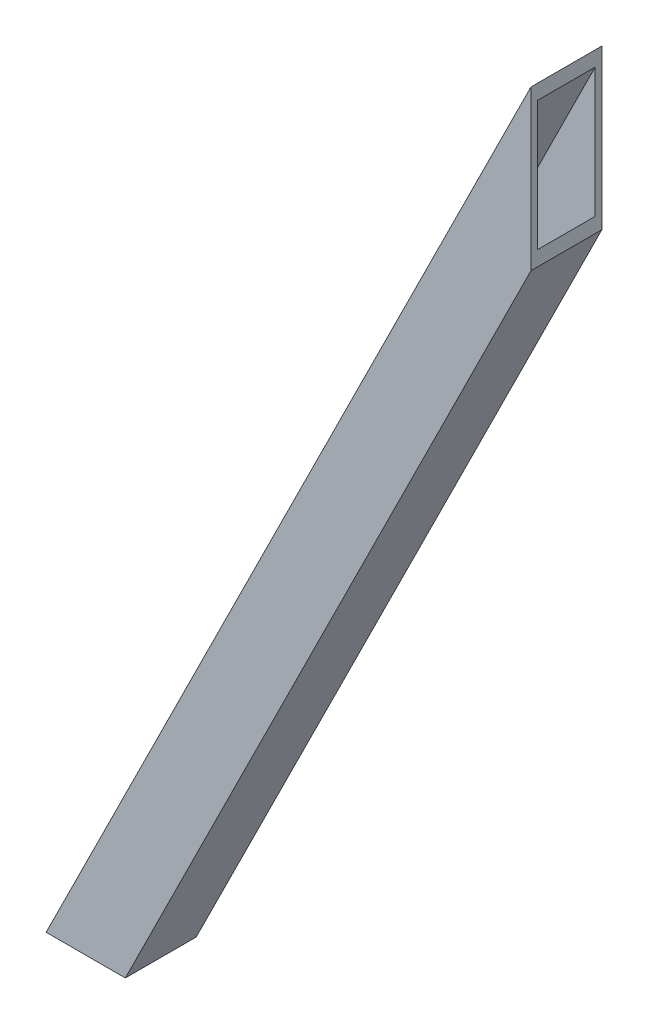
ISO-10303-21;
HEADER;
FILE_DESCRIPTION(('STEP AP214'),'2;1');
FILE_NAME('part.step','',(''),(''),'','','');
FILE_SCHEMA(('AUTOMOTIVE_DESIGN { 1 0 10303 214 1 1 1 1 }'));
ENDSEC;
DATA;
#1=APPLICATION_CONTEXT('core data for automotive mechanical design processes');
#2=APPLICATION_PROTOCOL_DEFINITION('international standard','automotive_design',2000,#1);
#3=PRODUCT_CONTEXT('',#1,'mechanical');
#4=PRODUCT('Part','Part','',(#3));
#5=PRODUCT_RELATED_PRODUCT_CATEGORY('part','',(#4));
#6=PRODUCT_DEFINITION_FORMATION('','',#4);
#7=PRODUCT_DEFINITION_CONTEXT('part definition',#1,'design');
#8=PRODUCT_DEFINITION('design','',#6,#7);
#9=PRODUCT_DEFINITION_SHAPE('','',#8);
#10=(LENGTH_UNIT() NAMED_UNIT(*) SI_UNIT(.MILLI.,.METRE.));
#11=(NAMED_UNIT(*) PLANE_ANGLE_UNIT() SI_UNIT($,.RADIAN.));
#12=(NAMED_UNIT(*) SI_UNIT($,.STERADIAN.) SOLID_ANGLE_UNIT());
#13=UNCERTAINTY_MEASURE_WITH_UNIT(LENGTH_MEASURE(1.E-05),#10,'distance_accuracy_value','');
#14=(GEOMETRIC_REPRESENTATION_CONTEXT(3) GLOBAL_UNCERTAINTY_ASSIGNED_CONTEXT((#13)) GLOBAL_UNIT_ASSIGNED_CONTEXT((#10,
#11,#12)) REPRESENTATION_CONTEXT('',''));
#15=CARTESIAN_POINT('',(0.,0.,0.));
#16=DIRECTION('',(0.,0.,1.));
#17=DIRECTION('',(1.,0.,0.));
#18=AXIS2_PLACEMENT_3D('',#15,#16,#17);
#19=CARTESIAN_POINT('',(-7.16249505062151,205.563518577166,8.00000000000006));
#20=DIRECTION('',(-0.895311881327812,0.445439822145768,0.));
#21=DIRECTION('',(-0.445439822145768,-0.895311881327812,0.));
#22=AXIS2_PLACEMENT_3D('',#19,#20,#21);
#23=PLANE('',#22);
#24=DIRECTION('',(-0.445439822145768,-0.895311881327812,0.));
#25=VECTOR('',#24,1.);
#26=CARTESIAN_POINT('',(-7.1624950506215,205.563518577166,-7.99999999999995));
#27=LINE('',#26,#25);
#28=CARTESIAN_POINT('',(8.88178419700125E-13,219.95977728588,-7.99999999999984));
#29=VERTEX_POINT('',#28);
#30=CARTESIAN_POINT('',(-109.435433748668,0.,-8.00000000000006));
#31=VERTEX_POINT('',#30);
#32=EDGE_CURVE('E114',#29,#31,#27,.T.);
#33=ORIENTED_EDGE('',*,*,#32,.T.);
#34=DIRECTION('',(0.,0.,1.));
#35=VECTOR('',#34,1.);
#36=CARTESIAN_POINT('',(-109.435433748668,0.,-8.00000000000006));
#37=LINE('',#36,#35);
#38=CARTESIAN_POINT('',(-109.435433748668,0.,7.99999999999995));
#39=VERTEX_POINT('',#38);
#40=EDGE_CURVE('E43',#31,#39,#37,.T.);
#41=ORIENTED_EDGE('',*,*,#40,.T.);
#42=DIRECTION('',(-0.445439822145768,-0.895311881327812,0.));
#43=VECTOR('',#42,1.);
#44=CARTESIAN_POINT('',(-7.16249505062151,205.563518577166,8.00000000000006));
#45=LINE('',#44,#43);
#46=CARTESIAN_POINT('',(8.11850586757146E-13,219.95977728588,8.00000000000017));
#47=VERTEX_POINT('',#46);
#48=EDGE_CURVE('E106',#47,#39,#45,.T.);
#49=ORIENTED_EDGE('',*,*,#48,.F.);
#50=DIRECTION('',(0.,0.,1.));
#51=VECTOR('',#50,1.);
#52=CARTESIAN_POINT('',(8.88178419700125E-13,219.95977728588,-7.99999999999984));
#53=LINE('',#52,#51);
#54=EDGE_CURVE('E151',#29,#47,#53,.T.);
#55=ORIENTED_EDGE('',*,*,#54,.F.);
#56=EDGE_LOOP('',(#33,#41,#49,#55));
#57=FACE_BOUND('',#56,.T.);
#58=ADVANCED_FACE('F28',(#57),#23,.T.);
#59=CARTESIAN_POINT('',(-7.16249505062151,205.563518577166,8.00000000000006));
#60=DIRECTION('',(0.,0.,-1.));
#61=DIRECTION('',(-1.,0.,0.));
#62=AXIS2_PLACEMENT_3D('',#59,#60,#61);
#63=PLANE('',#62);
#64=DIRECTION('',(1.,0.,0.));
#65=VECTOR('',#64,1.);
#66=CARTESIAN_POINT('',(-109.435433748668,0.,7.99999999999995));
#67=LINE('',#66,#65);
#68=CARTESIAN_POINT('',(-91.564566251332,3.33066907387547E-13,8.00000000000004));
#69=VERTEX_POINT('',#68);
#70=EDGE_CURVE('E93',#39,#69,#67,.T.);
#71=ORIENTED_EDGE('',*,*,#70,.T.);
#72=DIRECTION('',(-0.445439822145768,-0.895311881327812,0.));
#73=VECTOR('',#72,1.);
#74=CARTESIAN_POINT('',(7.16249505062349,198.436481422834,8.00000000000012));
#75=LINE('',#74,#73);
#76=CARTESIAN_POINT('',(9.99200722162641E-13,184.04022271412,8.00000000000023));
#77=VERTEX_POINT('',#76);
#78=EDGE_CURVE('E104',#77,#69,#75,.T.);
#79=ORIENTED_EDGE('',*,*,#78,.F.);
#80=DIRECTION('',(0.,1.,0.));
#81=VECTOR('',#80,1.);
#82=CARTESIAN_POINT('',(9.99200722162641E-13,184.04022271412,8.00000000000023));
#83=LINE('',#82,#81);
#84=EDGE_CURVE('E164',#77,#47,#83,.T.);
#85=ORIENTED_EDGE('',*,*,#84,.T.);
#86=ORIENTED_EDGE('',*,*,#48,.T.);
#87=EDGE_LOOP('',(#71,#79,#85,#86));
#88=FACE_BOUND('',#87,.T.);
#89=ADVANCED_FACE('F30',(#88),#63,.F.);
#90=CARTESIAN_POINT('',(7.16249505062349,198.436481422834,-7.9999999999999));
#91=DIRECTION('',(0.895311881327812,-0.445439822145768,0.));
#92=DIRECTION('',(0.445439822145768,0.895311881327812,0.));
#93=AXIS2_PLACEMENT_3D('',#90,#91,#92);
#94=PLANE('',#93);
#95=ORIENTED_EDGE('',*,*,#78,.T.);
#96=DIRECTION('',(0.,0.,1.));
#97=VECTOR('',#96,1.);
#98=CARTESIAN_POINT('',(-91.5645662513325,2.22044604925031E-13,-7.99999999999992));
#99=LINE('',#98,#97);
#100=CARTESIAN_POINT('',(-91.5645662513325,2.22044604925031E-13,-7.99999999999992));
#101=VERTEX_POINT('',#100);
#102=EDGE_CURVE('E90',#101,#69,#99,.T.);
#103=ORIENTED_EDGE('',*,*,#102,.F.);
#104=DIRECTION('',(-0.445439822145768,-0.895311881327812,0.));
#105=VECTOR('',#104,1.);
#106=CARTESIAN_POINT('',(7.16249505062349,198.436481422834,-7.9999999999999));
#107=LINE('',#106,#105);
#108=CARTESIAN_POINT('',(1.03736463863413E-12,184.04022271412,-7.99999999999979));
#109=VERTEX_POINT('',#108);
#110=EDGE_CURVE('E111',#109,#101,#107,.T.);
#111=ORIENTED_EDGE('',*,*,#110,.F.);
#112=DIRECTION('',(0.,0.,1.));
#113=VECTOR('',#112,1.);
#114=CARTESIAN_POINT('',(1.03736463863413E-12,184.04022271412,-7.99999999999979));
#115=LINE('',#114,#113);
#116=EDGE_CURVE('E110',#109,#77,#115,.T.);
#117=ORIENTED_EDGE('',*,*,#116,.T.);
#118=EDGE_LOOP('',(#95,#103,#111,#117));
#119=FACE_BOUND('',#118,.T.);
#120=ADVANCED_FACE('F109',(#119),#94,.T.);
#121=CARTESIAN_POINT('',(7.16249505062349,198.436481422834,-7.9999999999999));
#122=DIRECTION('',(0.,0.,1.));
#123=DIRECTION('',(1.,0.,0.));
#124=AXIS2_PLACEMENT_3D('',#121,#122,#123);
#125=PLANE('',#124);
#126=DIRECTION('',(1.,0.,0.));
#127=VECTOR('',#126,1.);
#128=CARTESIAN_POINT('',(-109.435433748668,0.,-8.00000000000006));
#129=LINE('',#128,#127);
#130=EDGE_CURVE('E94',#31,#101,#129,.T.);
#131=ORIENTED_EDGE('',*,*,#130,.F.);
#132=ORIENTED_EDGE('',*,*,#32,.F.);
#133=DIRECTION('',(0.,1.,0.));
#134=VECTOR('',#133,1.);
#135=CARTESIAN_POINT('',(1.03736463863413E-12,184.04022271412,-7.99999999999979));
#136=LINE('',#135,#134);
#137=EDGE_CURVE('E155',#109,#29,#136,.T.);
#138=ORIENTED_EDGE('',*,*,#137,.F.);
#139=ORIENTED_EDGE('',*,*,#110,.T.);
#140=EDGE_LOOP('',(#131,#132,#138,#139));
#141=FACE_BOUND('',#140,.T.);
#142=ADVANCED_FACE('F154',(#141),#125,.F.);
#143=CARTESIAN_POINT('',(8.66184356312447,204.81755557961,6.50000000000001));
#144=DIRECTION('',(0.,0.,1.));
#145=DIRECTION('',(1.,0.,0.));
#146=AXIS2_PLACEMENT_3D('',#143,#144,#145);
#147=PLANE('',#146);
#148=DIRECTION('',(1.,0.,0.));
#149=VECTOR('',#148,1.);
#150=CARTESIAN_POINT('',(8.66184356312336,1.11022302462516E-13,6.49999999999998));
#151=LINE('',#150,#149);
#152=CARTESIAN_POINT('',(-107.760039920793,0.,6.49999999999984));
#153=VERTEX_POINT('',#152);
#154=CARTESIAN_POINT('',(-93.2399600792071,0.,6.50000000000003));
#155=VERTEX_POINT('',#154);
#156=EDGE_CURVE('E162',#153,#155,#151,.T.);
#157=ORIENTED_EDGE('',*,*,#156,.F.);
#158=DIRECTION('',(-0.445439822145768,-0.895311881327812,0.));
#159=VECTOR('',#158,1.);
#160=CARTESIAN_POINT('',(-2.97721089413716,210.608273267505,6.49999999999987));
#161=LINE('',#160,#159);
#162=CARTESIAN_POINT('',(8.88178419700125E-13,216.592319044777,6.5000000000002));
#163=VERTEX_POINT('',#162);
#164=EDGE_CURVE('E139',#163,#153,#161,.T.);
#165=ORIENTED_EDGE('',*,*,#164,.F.);
#166=DIRECTION('',(0.,1.,0.));
#167=VECTOR('',#166,1.);
#168=CARTESIAN_POINT('',(9.99200722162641E-13,204.81755557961,6.4999999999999));
#169=LINE('',#168,#167);
#170=CARTESIAN_POINT('',(9.99200722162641E-13,187.407680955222,6.50000000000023));
#171=VERTEX_POINT('',#170);
#172=EDGE_CURVE('E124',#171,#163,#169,.T.);
#173=ORIENTED_EDGE('',*,*,#172,.F.);
#174=DIRECTION('',(-0.445439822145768,-0.895311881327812,0.));
#175=VECTOR('',#174,1.);
#176=CARTESIAN_POINT('',(8.66184356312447,204.81755557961,6.50000000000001));
#177=LINE('',#176,#175);
#178=EDGE_CURVE('E141',#171,#155,#177,.T.);
#179=ORIENTED_EDGE('',*,*,#178,.T.);
#180=EDGE_LOOP('',(#157,#165,#173,#179));
#181=FACE_BOUND('',#180,.T.);
#182=ADVANCED_FACE('F173',(#181),#147,.F.);
#183=CARTESIAN_POINT('',(8.66184356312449,204.81755557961,-6.49999999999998));
#184=DIRECTION('',(0.895311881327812,-0.445439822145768,0.));
#185=DIRECTION('',(0.445439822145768,0.895311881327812,0.));
#186=AXIS2_PLACEMENT_3D('',#183,#184,#185);
#187=PLANE('',#186);
#188=DIRECTION('',(0.,0.,-1.));
#189=VECTOR('',#188,1.);
#190=CARTESIAN_POINT('',(-93.2399600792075,4.71844785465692E-13,-6.49999999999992));
#191=LINE('',#190,#189);
#192=CARTESIAN_POINT('',(-93.2399600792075,4.71844785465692E-13,-6.49999999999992));
#193=VERTEX_POINT('',#192);
#194=EDGE_CURVE('E160',#155,#193,#191,.T.);
#195=ORIENTED_EDGE('',*,*,#194,.F.);
#196=ORIENTED_EDGE('',*,*,#178,.F.);
#197=DIRECTION('',(0.,0.,1.));
#198=VECTOR('',#197,1.);
#199=CARTESIAN_POINT('',(9.99200722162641E-13,187.407680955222,-6.49999999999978));
#200=LINE('',#199,#198);
#201=CARTESIAN_POINT('',(9.99200722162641E-13,187.407680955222,-6.49999999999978));
#202=VERTEX_POINT('',#201);
#203=EDGE_CURVE('E136',#202,#171,#200,.T.);
#204=ORIENTED_EDGE('',*,*,#203,.F.);
#205=DIRECTION('',(-0.445439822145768,-0.895311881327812,0.));
#206=VECTOR('',#205,1.);
#207=CARTESIAN_POINT('',(8.66184356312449,204.81755557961,-6.49999999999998));
#208=LINE('',#207,#206);
#209=EDGE_CURVE('E135',#202,#193,#208,.T.);
#210=ORIENTED_EDGE('',*,*,#209,.T.);
#211=EDGE_LOOP('',(#195,#196,#204,#210));
#212=FACE_BOUND('',#211,.T.);
#213=ADVANCED_FACE('F175',(#212),#187,.F.);
#214=CARTESIAN_POINT('',(-2.97721089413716,210.608273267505,-6.50000000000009));
#215=DIRECTION('',(0.,0.,-1.));
#216=DIRECTION('',(-1.,0.,0.));
#217=AXIS2_PLACEMENT_3D('',#214,#215,#216);
#218=PLANE('',#217);
#219=DIRECTION('',(-1.,0.,0.));
#220=VECTOR('',#219,1.);
#221=CARTESIAN_POINT('',(-2.97721089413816,3.60822483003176E-13,-6.49999999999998));
#222=LINE('',#221,#220);
#223=CARTESIAN_POINT('',(-107.760039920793,1.11022302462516E-13,-6.50000000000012));
#224=VERTEX_POINT('',#223);
#225=EDGE_CURVE('E50',#193,#224,#222,.T.);
#226=ORIENTED_EDGE('',*,*,#225,.F.);
#227=ORIENTED_EDGE('',*,*,#209,.F.);
#228=DIRECTION('',(0.,-1.,0.));
#229=VECTOR('',#228,1.);
#230=CARTESIAN_POINT('',(8.88178419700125E-13,210.608273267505,-6.49999999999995));
#231=LINE('',#230,#229);
#232=CARTESIAN_POINT('',(8.88178419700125E-13,216.592319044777,-6.49999999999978));
#233=VERTEX_POINT('',#232);
#234=EDGE_CURVE('E121',#233,#202,#231,.T.);
#235=ORIENTED_EDGE('',*,*,#234,.F.);
#236=DIRECTION('',(-0.445439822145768,-0.895311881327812,0.));
#237=VECTOR('',#236,1.);
#238=CARTESIAN_POINT('',(-2.97721089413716,210.608273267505,-6.50000000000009));
#239=LINE('',#238,#237);
#240=EDGE_CURVE('E133',#233,#224,#239,.T.);
#241=ORIENTED_EDGE('',*,*,#240,.T.);
#242=EDGE_LOOP('',(#226,#227,#235,#241));
#243=FACE_BOUND('',#242,.T.);
#244=ADVANCED_FACE('F132',(#243),#218,.F.);
#245=CARTESIAN_POINT('',(-2.97721089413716,210.608273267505,6.49999999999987));
#246=DIRECTION('',(-0.895311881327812,0.445439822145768,0.));
#247=DIRECTION('',(-0.445439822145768,-0.895311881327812,0.));
#248=AXIS2_PLACEMENT_3D('',#245,#246,#247);
#249=PLANE('',#248);
#250=DIRECTION('',(0.,0.,1.));
#251=VECTOR('',#250,1.);
#252=CARTESIAN_POINT('',(-107.760039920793,0.,6.49999999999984));
#253=LINE('',#252,#251);
#254=EDGE_CURVE('E11',#224,#153,#253,.T.);
#255=ORIENTED_EDGE('',*,*,#254,.F.);
#256=ORIENTED_EDGE('',*,*,#240,.F.);
#257=DIRECTION('',(0.,0.,-1.));
#258=VECTOR('',#257,1.);
#259=CARTESIAN_POINT('',(8.88178419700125E-13,216.592319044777,6.5000000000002));
#260=LINE('',#259,#258);
#261=EDGE_CURVE('E36',#163,#233,#260,.T.);
#262=ORIENTED_EDGE('',*,*,#261,.F.);
#263=ORIENTED_EDGE('',*,*,#164,.T.);
#264=EDGE_LOOP('',(#255,#256,#262,#263));
#265=FACE_BOUND('',#264,.T.);
#266=ADVANCED_FACE('F138',(#265),#249,.F.);
#267=CARTESIAN_POINT('',(1.03736463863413E-12,184.04022271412,-7.99999999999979));
#268=DIRECTION('',(1.,0.,0.));
#269=DIRECTION('',(0.,1.,0.));
#270=AXIS2_PLACEMENT_3D('',#267,#268,#269);
#271=PLANE('',#270);
#272=ORIENTED_EDGE('',*,*,#54,.T.);
#273=ORIENTED_EDGE('',*,*,#84,.F.);
#274=ORIENTED_EDGE('',*,*,#116,.F.);
#275=ORIENTED_EDGE('',*,*,#137,.T.);
#276=EDGE_LOOP('',(#272,#273,#274,#275));
#277=FACE_BOUND('',#276,.T.);
#278=ORIENTED_EDGE('',*,*,#172,.T.);
#279=ORIENTED_EDGE('',*,*,#261,.T.);
#280=ORIENTED_EDGE('',*,*,#234,.T.);
#281=ORIENTED_EDGE('',*,*,#203,.T.);
#282=EDGE_LOOP('',(#278,#279,#280,#281));
#283=FACE_BOUND('',#282,.T.);
#284=ADVANCED_FACE('F120',(#277,#283),#271,.T.);
#285=CARTESIAN_POINT('',(-109.435433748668,0.,-8.00000000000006));
#286=DIRECTION('',(0.,-1.,0.));
#287=DIRECTION('',(0.,0.,-1.));
#288=AXIS2_PLACEMENT_3D('',#285,#286,#287);
#289=PLANE('',#288);
#290=ORIENTED_EDGE('',*,*,#102,.T.);
#291=ORIENTED_EDGE('',*,*,#70,.F.);
#292=ORIENTED_EDGE('',*,*,#40,.F.);
#293=ORIENTED_EDGE('',*,*,#130,.T.);
#294=EDGE_LOOP('',(#290,#291,#292,#293));
#295=FACE_BOUND('',#294,.T.);
#296=ORIENTED_EDGE('',*,*,#156,.T.);
#297=ORIENTED_EDGE('',*,*,#194,.T.);
#298=ORIENTED_EDGE('',*,*,#225,.T.);
#299=ORIENTED_EDGE('',*,*,#254,.T.);
#300=EDGE_LOOP('',(#296,#297,#298,#299));
#301=FACE_BOUND('',#300,.T.);
#302=ADVANCED_FACE('F92',(#295,#301),#289,.T.);
#303=CLOSED_SHELL('',(#58,#89,#120,#142,#182,#213,#244,#266,#284,#302));
#304=MANIFOLD_SOLID_BREP('B2',#303);
#305=ADVANCED_BREP_SHAPE_REPRESENTATION('',(#18,#304),#14);
#306=SHAPE_DEFINITION_REPRESENTATION(#9,#305);
ENDSEC;
END-ISO-10303-21;
